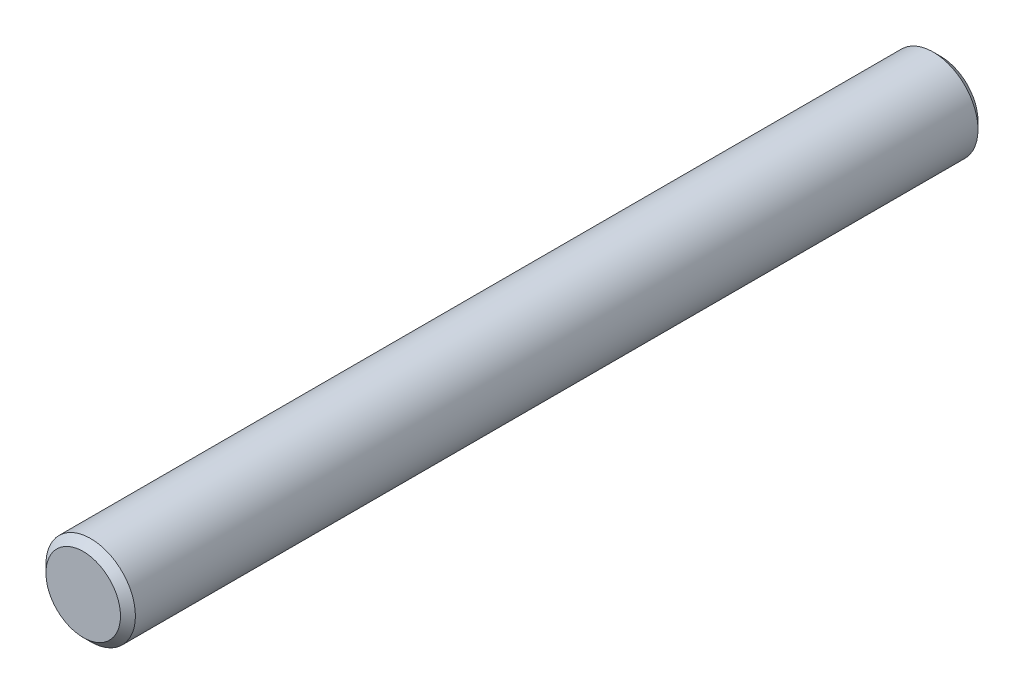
from build123d import *

# Parameters (mm, degrees)
ESQUISSE1_R      = 6
EXTRUSION1_DEPTH = 115
CHANFREIN1_SIZE  = 1


with BuildPart() as part:
    # Esquisse1 → Extrusion1 (new body)
    with BuildSketch(Plane.XY):
        Circle(ESQUISSE1_R)
    extrude(amount=EXTRUSION1_DEPTH)

    # Chanfrein1
    chanfrein1_edges = [part.edges().sort_by_distance(p)[0] for p in [
        (-6, 0, 0),
        (-6, 0, 115),
    ]]
    chamfer(chanfrein1_edges, length=CHANFREIN1_SIZE)


solid = part.part
